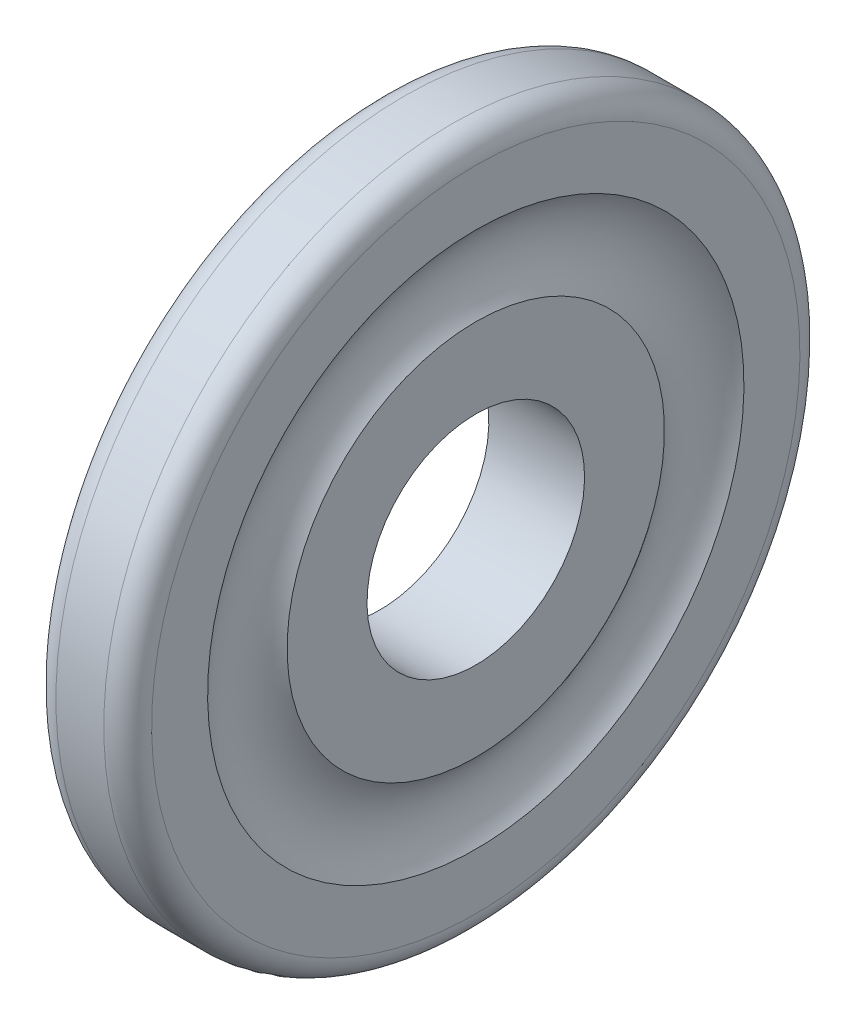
ISO-10303-21;
HEADER;
FILE_DESCRIPTION(('STEP AP214'),'2;1');
FILE_NAME('part.step','',(''),(''),'','','');
FILE_SCHEMA(('AUTOMOTIVE_DESIGN { 1 0 10303 214 1 1 1 1 }'));
ENDSEC;
DATA;
#1=APPLICATION_CONTEXT('core data for automotive mechanical design processes');
#2=APPLICATION_PROTOCOL_DEFINITION('international standard','automotive_design',2000,#1);
#3=PRODUCT_CONTEXT('',#1,'mechanical');
#4=PRODUCT('Part','Part','',(#3));
#5=PRODUCT_RELATED_PRODUCT_CATEGORY('part','',(#4));
#6=PRODUCT_DEFINITION_FORMATION('','',#4);
#7=PRODUCT_DEFINITION_CONTEXT('part definition',#1,'design');
#8=PRODUCT_DEFINITION('design','',#6,#7);
#9=PRODUCT_DEFINITION_SHAPE('','',#8);
#10=(LENGTH_UNIT() NAMED_UNIT(*) SI_UNIT(.MILLI.,.METRE.));
#11=(NAMED_UNIT(*) PLANE_ANGLE_UNIT() SI_UNIT($,.RADIAN.));
#12=(NAMED_UNIT(*) SI_UNIT($,.STERADIAN.) SOLID_ANGLE_UNIT());
#13=UNCERTAINTY_MEASURE_WITH_UNIT(LENGTH_MEASURE(1.E-05),#10,'distance_accuracy_value','');
#14=(GEOMETRIC_REPRESENTATION_CONTEXT(3) GLOBAL_UNCERTAINTY_ASSIGNED_CONTEXT((#13)) GLOBAL_UNIT_ASSIGNED_CONTEXT((#10,
#11,#12)) REPRESENTATION_CONTEXT('',''));
#15=CARTESIAN_POINT('',(0.,0.,0.));
#16=DIRECTION('',(0.,0.,1.));
#17=DIRECTION('',(1.,0.,0.));
#18=AXIS2_PLACEMENT_3D('',#15,#16,#17);
#19=CARTESIAN_POINT('',(8.8,6.83627137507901,0.));
#20=DIRECTION('',(-1.,0.,0.));
#21=DIRECTION('',(0.,0.,1.));
#22=AXIS2_PLACEMENT_3D('',#19,#20,#21);
#23=PLANE('',#22);
#24=CARTESIAN_POINT('',(8.8,0.,0.));
#25=DIRECTION('',(-1.,0.,0.));
#26=DIRECTION('',(0.,1.,0.));
#27=AXIS2_PLACEMENT_3D('',#24,#25,#26);
#28=CIRCLE('',#27,5.);
#29=CARTESIAN_POINT('',(8.8,5.,0.));
#30=VERTEX_POINT('',#29);
#31=EDGE_CURVE('E101',#30,#30,#28,.T.);
#32=ORIENTED_EDGE('',*,*,#31,.F.);
#33=EDGE_LOOP('',(#32));
#34=FACE_BOUND('',#33,.T.);
#35=CARTESIAN_POINT('',(8.8,0.,0.));
#36=DIRECTION('',(-1.,0.,0.));
#37=DIRECTION('',(0.,1.,0.));
#38=AXIS2_PLACEMENT_3D('',#35,#36,#37);
#39=CIRCLE('',#38,8.67254275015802);
#40=CARTESIAN_POINT('',(8.8,8.67254275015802,0.));
#41=VERTEX_POINT('',#40);
#42=EDGE_CURVE('E10',#41,#41,#39,.T.);
#43=ORIENTED_EDGE('',*,*,#42,.T.);
#44=EDGE_LOOP('',(#43));
#45=FACE_BOUND('',#44,.T.);
#46=ADVANCED_FACE('F15',(#34,#45),#23,.T.);
#47=CARTESIAN_POINT('',(8.8,13.613728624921,0.));
#48=DIRECTION('',(-1.,0.,0.));
#49=DIRECTION('',(0.,-1.,0.));
#50=AXIS2_PLACEMENT_3D('',#47,#48,#49);
#51=PLANE('',#50);
#52=CARTESIAN_POINT('',(8.8,0.,0.));
#53=DIRECTION('',(-1.,0.,0.));
#54=DIRECTION('',(0.,1.,0.));
#55=AXIS2_PLACEMENT_3D('',#52,#53,#54);
#56=CIRCLE('',#55,12.327457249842);
#57=CARTESIAN_POINT('',(8.8,12.327457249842,0.));
#58=VERTEX_POINT('',#57);
#59=EDGE_CURVE('E104',#58,#58,#56,.T.);
#60=ORIENTED_EDGE('',*,*,#59,.F.);
#61=EDGE_LOOP('',(#60));
#62=FACE_BOUND('',#61,.T.);
#63=CARTESIAN_POINT('',(8.8,0.,0.));
#64=DIRECTION('',(-1.,0.,0.));
#65=DIRECTION('',(0.,1.,0.));
#66=AXIS2_PLACEMENT_3D('',#63,#64,#65);
#67=CIRCLE('',#66,14.9);
#68=CARTESIAN_POINT('',(8.8,14.9,0.));
#69=VERTEX_POINT('',#68);
#70=EDGE_CURVE('E23',#69,#69,#67,.T.);
#71=ORIENTED_EDGE('',*,*,#70,.T.);
#72=EDGE_LOOP('',(#71));
#73=FACE_BOUND('',#72,.T.);
#74=ADVANCED_FACE('F77',(#62,#73),#51,.T.);
#75=CARTESIAN_POINT('',(13.2,13.613728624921,0.));
#76=DIRECTION('',(1.,0.,0.));
#77=DIRECTION('',(0.,0.,-1.));
#78=AXIS2_PLACEMENT_3D('',#75,#76,#77);
#79=PLANE('',#78);
#80=CARTESIAN_POINT('',(13.2,0.,0.));
#81=DIRECTION('',(-1.,0.,0.));
#82=DIRECTION('',(0.,1.,0.));
#83=AXIS2_PLACEMENT_3D('',#80,#81,#82);
#84=CIRCLE('',#83,12.327457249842);
#85=CARTESIAN_POINT('',(13.2,12.327457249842,0.));
#86=VERTEX_POINT('',#85);
#87=EDGE_CURVE('E28',#86,#86,#84,.T.);
#88=ORIENTED_EDGE('',*,*,#87,.T.);
#89=EDGE_LOOP('',(#88));
#90=FACE_BOUND('',#89,.T.);
#91=CARTESIAN_POINT('',(13.2,0.,0.));
#92=DIRECTION('',(-1.,0.,0.));
#93=DIRECTION('',(0.,1.,0.));
#94=AXIS2_PLACEMENT_3D('',#91,#92,#93);
#95=CIRCLE('',#94,14.9);
#96=CARTESIAN_POINT('',(13.2,14.9,0.));
#97=VERTEX_POINT('',#96);
#98=EDGE_CURVE('E34',#97,#97,#95,.T.);
#99=ORIENTED_EDGE('',*,*,#98,.F.);
#100=EDGE_LOOP('',(#99));
#101=FACE_BOUND('',#100,.T.);
#102=ADVANCED_FACE('F83',(#90,#101),#79,.T.);
#103=CARTESIAN_POINT('',(13.2,6.83627137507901,0.));
#104=DIRECTION('',(1.,0.,0.));
#105=DIRECTION('',(0.,0.,-1.));
#106=AXIS2_PLACEMENT_3D('',#103,#104,#105);
#107=PLANE('',#106);
#108=CARTESIAN_POINT('',(13.2,0.,0.));
#109=DIRECTION('',(-1.,0.,0.));
#110=DIRECTION('',(0.,1.,0.));
#111=AXIS2_PLACEMENT_3D('',#108,#109,#110);
#112=CIRCLE('',#111,5.);
#113=CARTESIAN_POINT('',(13.2,5.,0.));
#114=VERTEX_POINT('',#113);
#115=EDGE_CURVE('E39',#114,#114,#112,.T.);
#116=ORIENTED_EDGE('',*,*,#115,.T.);
#117=EDGE_LOOP('',(#116));
#118=FACE_BOUND('',#117,.T.);
#119=CARTESIAN_POINT('',(13.2,0.,0.));
#120=DIRECTION('',(-1.,0.,0.));
#121=DIRECTION('',(0.,1.,0.));
#122=AXIS2_PLACEMENT_3D('',#119,#120,#121);
#123=CIRCLE('',#122,8.67254275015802);
#124=CARTESIAN_POINT('',(13.2,8.67254275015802,0.));
#125=VERTEX_POINT('',#124);
#126=EDGE_CURVE('E37',#125,#125,#123,.T.);
#127=ORIENTED_EDGE('',*,*,#126,.F.);
#128=EDGE_LOOP('',(#127));
#129=FACE_BOUND('',#128,.T.);
#130=ADVANCED_FACE('F52',(#118,#129),#107,.T.);
#131=CARTESIAN_POINT('',(15.4,0.,0.));
#132=DIRECTION('',(-1.,0.,0.));
#133=DIRECTION('',(0.,0.,1.));
#134=AXIS2_PLACEMENT_3D('',#131,#132,#133);
#135=TOROIDAL_SURFACE('',#134,10.5,2.86);
#136=ORIENTED_EDGE('',*,*,#126,.T.);
#137=EDGE_LOOP('',(#136));
#138=FACE_BOUND('',#137,.T.);
#139=ORIENTED_EDGE('',*,*,#87,.F.);
#140=EDGE_LOOP('',(#139));
#141=FACE_BOUND('',#140,.T.);
#142=ADVANCED_FACE('F47',(#138,#141),#135,.F.);
#143=CARTESIAN_POINT('',(12.1,0.,0.));
#144=DIRECTION('',(-1.,0.,0.));
#145=DIRECTION('',(0.,0.,1.));
#146=AXIS2_PLACEMENT_3D('',#143,#144,#145);
#147=TOROIDAL_SURFACE('',#146,14.9,1.09999999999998);
#148=ORIENTED_EDGE('',*,*,#98,.T.);
#149=EDGE_LOOP('',(#148));
#150=FACE_BOUND('',#149,.T.);
#151=CARTESIAN_POINT('',(12.1,0.,0.));
#152=DIRECTION('',(-1.,0.,0.));
#153=DIRECTION('',(0.,1.,0.));
#154=AXIS2_PLACEMENT_3D('',#151,#152,#153);
#155=CIRCLE('',#154,16.);
#156=CARTESIAN_POINT('',(12.1,16.,0.));
#157=VERTEX_POINT('',#156);
#158=EDGE_CURVE('E99',#157,#157,#155,.T.);
#159=ORIENTED_EDGE('',*,*,#158,.F.);
#160=EDGE_LOOP('',(#159));
#161=FACE_BOUND('',#160,.T.);
#162=ADVANCED_FACE('F51',(#150,#161),#147,.T.);
#163=CARTESIAN_POINT('',(11.,0.,0.));
#164=DIRECTION('',(-1.,0.,0.));
#165=DIRECTION('',(0.,0.,1.));
#166=AXIS2_PLACEMENT_3D('',#163,#164,#165);
#167=CYLINDRICAL_SURFACE('',#166,16.);
#168=CARTESIAN_POINT('',(9.9,0.,0.));
#169=DIRECTION('',(-1.,0.,0.));
#170=DIRECTION('',(0.,1.,0.));
#171=AXIS2_PLACEMENT_3D('',#168,#169,#170);
#172=CIRCLE('',#171,16.);
#173=CARTESIAN_POINT('',(9.9,16.,0.));
#174=VERTEX_POINT('',#173);
#175=EDGE_CURVE('E32',#174,#174,#172,.T.);
#176=ORIENTED_EDGE('',*,*,#175,.F.);
#177=EDGE_LOOP('',(#176));
#178=FACE_BOUND('',#177,.T.);
#179=ORIENTED_EDGE('',*,*,#158,.T.);
#180=EDGE_LOOP('',(#179));
#181=FACE_BOUND('',#180,.T.);
#182=ADVANCED_FACE('F57',(#178,#181),#167,.T.);
#183=CARTESIAN_POINT('',(9.89999999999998,0.,0.));
#184=DIRECTION('',(-1.,0.,0.));
#185=DIRECTION('',(0.,0.,1.));
#186=AXIS2_PLACEMENT_3D('',#183,#184,#185);
#187=TOROIDAL_SURFACE('',#186,14.9,1.09999999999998);
#188=ORIENTED_EDGE('',*,*,#175,.T.);
#189=EDGE_LOOP('',(#188));
#190=FACE_BOUND('',#189,.T.);
#191=ORIENTED_EDGE('',*,*,#70,.F.);
#192=EDGE_LOOP('',(#191));
#193=FACE_BOUND('',#192,.T.);
#194=ADVANCED_FACE('F61',(#190,#193),#187,.T.);
#195=CARTESIAN_POINT('',(6.60000000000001,0.,0.));
#196=DIRECTION('',(-1.,0.,0.));
#197=DIRECTION('',(0.,0.,1.));
#198=AXIS2_PLACEMENT_3D('',#195,#196,#197);
#199=TOROIDAL_SURFACE('',#198,10.5,2.86);
#200=ORIENTED_EDGE('',*,*,#59,.T.);
#201=EDGE_LOOP('',(#200));
#202=FACE_BOUND('',#201,.T.);
#203=ORIENTED_EDGE('',*,*,#42,.F.);
#204=EDGE_LOOP('',(#203));
#205=FACE_BOUND('',#204,.T.);
#206=ADVANCED_FACE('F64',(#202,#205),#199,.F.);
#207=CARTESIAN_POINT('',(11.,0.,0.));
#208=DIRECTION('',(-1.,0.,0.));
#209=DIRECTION('',(0.,0.,1.));
#210=AXIS2_PLACEMENT_3D('',#207,#208,#209);
#211=CYLINDRICAL_SURFACE('',#210,5.);
#212=ORIENTED_EDGE('',*,*,#115,.F.);
#213=EDGE_LOOP('',(#212));
#214=FACE_BOUND('',#213,.T.);
#215=ORIENTED_EDGE('',*,*,#31,.T.);
#216=EDGE_LOOP('',(#215));
#217=FACE_BOUND('',#216,.T.);
#218=ADVANCED_FACE('F17',(#214,#217),#211,.F.);
#219=CLOSED_SHELL('',(#46,#74,#102,#130,#142,#162,#182,#194,#206,#218));
#220=MANIFOLD_SOLID_BREP('B1',#219);
#221=ADVANCED_BREP_SHAPE_REPRESENTATION('',(#18,#220),#14);
#222=SHAPE_DEFINITION_REPRESENTATION(#9,#221);
ENDSEC;
END-ISO-10303-21;
